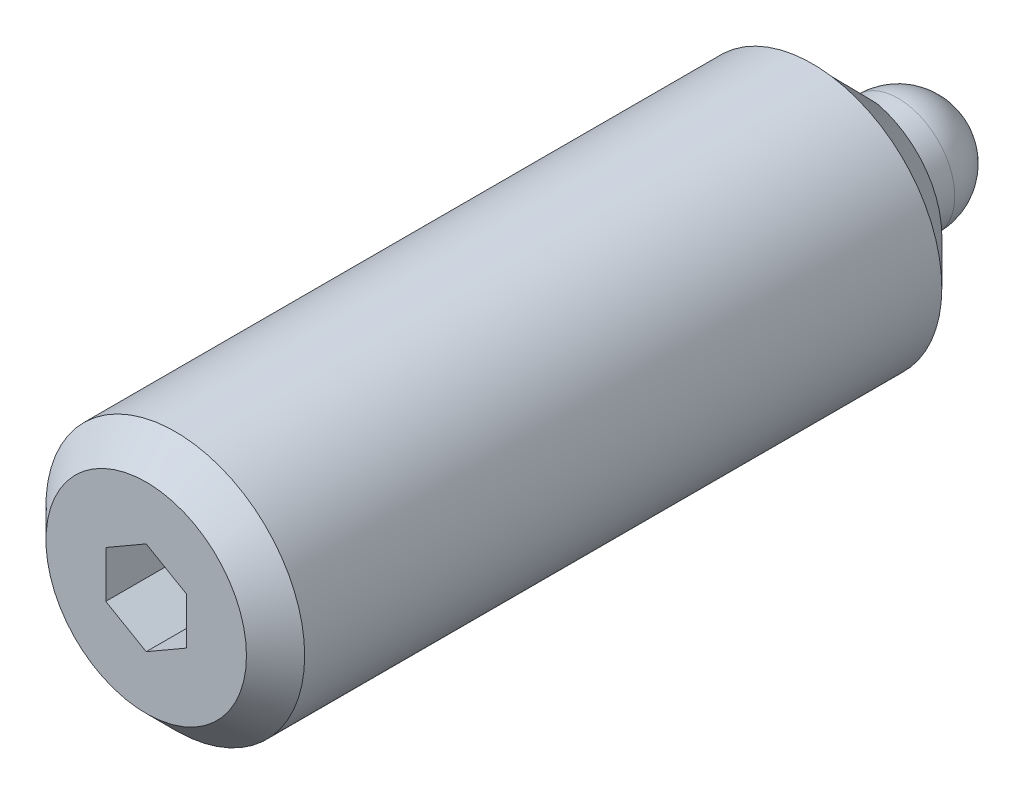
ISO-10303-21;
HEADER;
FILE_DESCRIPTION(('STEP AP214'),'2;1');
FILE_NAME('part.step','',(''),(''),'','','');
FILE_SCHEMA(('AUTOMOTIVE_DESIGN { 1 0 10303 214 1 1 1 1 }'));
ENDSEC;
DATA;
#1=APPLICATION_CONTEXT('core data for automotive mechanical design processes');
#2=APPLICATION_PROTOCOL_DEFINITION('international standard','automotive_design',2000,#1);
#3=PRODUCT_CONTEXT('',#1,'mechanical');
#4=PRODUCT('Part','Part','',(#3));
#5=PRODUCT_RELATED_PRODUCT_CATEGORY('part','',(#4));
#6=PRODUCT_DEFINITION_FORMATION('','',#4);
#7=PRODUCT_DEFINITION_CONTEXT('part definition',#1,'design');
#8=PRODUCT_DEFINITION('design','',#6,#7);
#9=PRODUCT_DEFINITION_SHAPE('','',#8);
#10=(LENGTH_UNIT() NAMED_UNIT(*) SI_UNIT(.MILLI.,.METRE.));
#11=(NAMED_UNIT(*) PLANE_ANGLE_UNIT() SI_UNIT($,.RADIAN.));
#12=(NAMED_UNIT(*) SI_UNIT($,.STERADIAN.) SOLID_ANGLE_UNIT());
#13=UNCERTAINTY_MEASURE_WITH_UNIT(LENGTH_MEASURE(1.E-05),#10,'distance_accuracy_value','');
#14=(GEOMETRIC_REPRESENTATION_CONTEXT(3) GLOBAL_UNCERTAINTY_ASSIGNED_CONTEXT((#13)) GLOBAL_UNIT_ASSIGNED_CONTEXT((#10,
#11,#12)) REPRESENTATION_CONTEXT('',''));
#15=CARTESIAN_POINT('',(0.,0.,0.));
#16=DIRECTION('',(0.,0.,1.));
#17=DIRECTION('',(1.,0.,0.));
#18=AXIS2_PLACEMENT_3D('',#15,#16,#17);
#19=CARTESIAN_POINT('',(0.,1.75,3.));
#20=DIRECTION('',(0.,0.,-1.));
#21=DIRECTION('',(-1.,0.,0.));
#22=AXIS2_PLACEMENT_3D('',#19,#20,#21);
#23=PLANE('',#22);
#24=DIRECTION('',(0.,-1.,0.));
#25=VECTOR('',#24,1.);
#26=CARTESIAN_POINT('',(0.6,-1.64392822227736,3.));
#27=LINE('',#26,#25);
#28=CARTESIAN_POINT('',(0.6,-1.64392822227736,3.));
#29=VERTEX_POINT('',#28);
#30=CARTESIAN_POINT('',(0.6,-2.5298221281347,3.));
#31=VERTEX_POINT('',#30);
#32=EDGE_CURVE('E130',#29,#31,#27,.T.);
#33=ORIENTED_EDGE('',*,*,#32,.F.);
#34=CARTESIAN_POINT('',(0.,0.,3.));
#35=DIRECTION('',(0.,0.,-1.));
#36=DIRECTION('',(-1.,0.,0.));
#37=AXIS2_PLACEMENT_3D('',#34,#35,#36);
#38=CIRCLE('',#37,1.75);
#39=CARTESIAN_POINT('',(0.6,1.64392822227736,3.));
#40=VERTEX_POINT('',#39);
#41=EDGE_CURVE('E219',#40,#29,#38,.T.);
#42=ORIENTED_EDGE('',*,*,#41,.F.);
#43=DIRECTION('',(0.,-1.,0.));
#44=VECTOR('',#43,1.);
#45=CARTESIAN_POINT('',(0.6,4.62355278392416,3.));
#46=LINE('',#45,#44);
#47=CARTESIAN_POINT('',(0.6,2.5298221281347,3.));
#48=VERTEX_POINT('',#47);
#49=EDGE_CURVE('E149',#48,#40,#46,.T.);
#50=ORIENTED_EDGE('',*,*,#49,.F.);
#51=CARTESIAN_POINT('',(0.,0.,3.));
#52=DIRECTION('',(0.,0.,-1.));
#53=DIRECTION('',(-1.,0.,0.));
#54=AXIS2_PLACEMENT_3D('',#51,#52,#53);
#55=CIRCLE('',#54,2.6);
#56=EDGE_CURVE('E228',#48,#31,#55,.T.);
#57=ORIENTED_EDGE('',*,*,#56,.T.);
#58=EDGE_LOOP('',(#33,#42,#50,#57));
#59=FACE_BOUND('',#58,.T.);
#60=ADVANCED_FACE('F14',(#59),#23,.T.);
#61=CARTESIAN_POINT('',(0.,0.,3.));
#62=DIRECTION('',(0.,0.,1.));
#63=DIRECTION('',(1.,0.,0.));
#64=AXIS2_PLACEMENT_3D('',#61,#62,#63);
#65=CONICAL_SURFACE('',#64,2.6,0.785398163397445);
#66=CARTESIAN_POINT('',(0.6,-0.316435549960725,1.07832990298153));
#67=CARTESIAN_POINT('',(0.6,-0.342049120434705,1.09030088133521));
#68=CARTESIAN_POINT('',(0.6,-0.367221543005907,1.10315656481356));
#69=CARTESIAN_POINT('',(0.6,-0.416776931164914,1.13024973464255));
#70=CARTESIAN_POINT('',(0.6,-0.441160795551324,1.14448556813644));
#71=CARTESIAN_POINT('',(0.6,-0.489209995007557,1.17393130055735));
#72=CARTESIAN_POINT('',(0.6,-0.512877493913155,1.18913771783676));
#73=CARTESIAN_POINT('',(0.6,-0.55969644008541,1.22033885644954));
#74=CARTESIAN_POINT('',(0.6,-0.58284770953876,1.23633384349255));
#75=CARTESIAN_POINT('',(0.6,-0.65147502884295,1.28508689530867));
#76=CARTESIAN_POINT('',(0.6,-0.696316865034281,1.31873506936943));
#77=CARTESIAN_POINT('',(0.6,-0.784878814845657,1.38755469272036));
#78=CARTESIAN_POINT('',(0.6,-0.828597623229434,1.42272779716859));
#79=CARTESIAN_POINT('',(0.6,-0.918811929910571,1.49704479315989));
#80=CARTESIAN_POINT('',(0.6,-0.965235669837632,1.53627551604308));
#81=CARTESIAN_POINT('',(0.6,-1.05739460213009,1.61553936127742));
#82=CARTESIAN_POINT('',(0.6,-1.10312974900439,1.65557253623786));
#83=CARTESIAN_POINT('',(0.6,-1.23960662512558,1.7765268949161));
#84=CARTESIAN_POINT('',(0.6,-1.32960230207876,1.85828816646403));
#85=CARTESIAN_POINT('',(0.6,-1.5084598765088,2.0230422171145));
#86=CARTESIAN_POINT('',(0.6,-1.59732170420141,2.10603507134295));
#87=CARTESIAN_POINT('',(0.6,-1.77431085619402,2.27277843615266));
#88=CARTESIAN_POINT('',(0.6,-1.86243826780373,2.3565288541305));
#89=CARTESIAN_POINT('',(0.6,-2.03884556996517,2.52513938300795));
#90=CARTESIAN_POINT('',(0.6,-2.12712196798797,2.61000314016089));
#91=CARTESIAN_POINT('',(0.6,-2.30333427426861,2.78008863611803));
#92=CARTESIAN_POINT('',(0.6,-2.3912701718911,2.86531038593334));
#93=CARTESIAN_POINT('',(0.6,-2.65467456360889,3.12131790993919));
#94=CARTESIAN_POINT('',(0.6,-2.82977616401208,3.29248094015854));
#95=CARTESIAN_POINT('',(0.6,-3.21925194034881,3.67442164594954));
#96=CARTESIAN_POINT('',(0.6,-3.43348622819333,3.88534172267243));
#97=CARTESIAN_POINT('',(0.6,-3.86149450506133,4.30767822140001));
#98=CARTESIAN_POINT('',(0.6,-4.07526846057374,4.51909467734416));
#99=CARTESIAN_POINT('',(0.6,-4.50037387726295,4.94009936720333));
#100=CARTESIAN_POINT('',(0.6,-4.71170829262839,5.14968461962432));
#101=CARTESIAN_POINT('',(0.6,-5.13416047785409,5.56904170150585));
#102=CARTESIAN_POINT('',(0.6,-5.34527826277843,5.77881351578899));
#103=CARTESIAN_POINT('',(0.6,-5.55634000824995,5.98864154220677));
#104=B_SPLINE_CURVE_WITH_KNOTS('',3,(#66,#67,#68,#69,#70,#71,#72,#73,#74,#75,#76,#77,#78,#79,
#80,#81,#82,#83,#84,#85,#86,#87,#88,#89,#90,#91,#92,#93,#94,#95,#96,#97,#98,#99,#100,#101,#102,
#103),.UNSPECIFIED.,.F.,.F.,(4,2,2,2,2,2,2,2,2,2,2,2,2,2,2,2,2,2,4),(0.,0.0847656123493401,
0.169430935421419,0.25380798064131,0.338213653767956,0.506342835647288,0.674659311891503,
0.856985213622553,1.03932310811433,1.40406749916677,1.76883423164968,2.13355696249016,
2.50091282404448,2.86828006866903,3.60286309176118,4.50477798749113,5.40675645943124,
6.29966947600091,7.19251550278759),.UNSPECIFIED.);
#105=CARTESIAN_POINT('',(0.6,-3.95474398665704,4.4));
#106=VERTEX_POINT('',#105);
#107=EDGE_CURVE('E9',#31,#106,#104,.T.);
#108=ORIENTED_EDGE('',*,*,#107,.F.);
#109=ORIENTED_EDGE('',*,*,#56,.F.);
#110=CARTESIAN_POINT('',(0.6,5.01244134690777,5.44822426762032));
#111=CARTESIAN_POINT('',(0.6,4.82054600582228,5.25770551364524));
#112=CARTESIAN_POINT('',(0.6,4.62858848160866,5.06724910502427));
#113=CARTESIAN_POINT('',(0.6,4.24445981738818,4.68657611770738));
#114=CARTESIAN_POINT('',(0.6,4.05228869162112,4.49635952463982));
#115=CARTESIAN_POINT('',(0.6,3.667674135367,4.11631134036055));
#116=CARTESIAN_POINT('',(0.6,3.4752307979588,3.92647965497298));
#117=CARTESIAN_POINT('',(0.6,3.08981097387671,3.54733285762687));
#118=CARTESIAN_POINT('',(0.6,2.89683445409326,3.35801777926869));
#119=CARTESIAN_POINT('',(0.6,2.62414822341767,3.09181500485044));
#120=CARTESIAN_POINT('',(0.6,2.54482409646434,3.01453245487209));
#121=CARTESIAN_POINT('',(0.6,2.38596933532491,2.86018171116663));
#122=CARTESIAN_POINT('',(0.6,2.30643870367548,2.78311351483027));
#123=CARTESIAN_POINT('',(0.6,2.14711369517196,2.62927512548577));
#124=CARTESIAN_POINT('',(0.6,2.06731936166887,2.55250488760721));
#125=CARTESIAN_POINT('',(0.6,1.90734638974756,2.39935828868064));
#126=CARTESIAN_POINT('',(0.6,1.82716773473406,2.32298194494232));
#127=CARTESIAN_POINT('',(0.6,1.66622286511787,2.17076654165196));
#128=CARTESIAN_POINT('',(0.6,1.58545636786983,2.09492778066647));
#129=CARTESIAN_POINT('',(0.6,1.42311729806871,1.94413311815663));
#130=CARTESIAN_POINT('',(0.6,1.34154482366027,1.86917711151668));
#131=CARTESIAN_POINT('',(0.6,1.21817701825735,1.7578095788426));
#132=CARTESIAN_POINT('',(0.6,1.1768736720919,1.7208538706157));
#133=CARTESIAN_POINT('',(0.6,1.09383421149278,1.64743627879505));
#134=CARTESIAN_POINT('',(0.6,1.05209812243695,1.61097436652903));
#135=CARTESIAN_POINT('',(0.6,0.968037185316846,1.53869511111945));
#136=CARTESIAN_POINT('',(0.6,0.925712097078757,1.50287804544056));
#137=CARTESIAN_POINT('',(0.6,0.840247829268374,1.43221316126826));
#138=CARTESIAN_POINT('',(0.6,0.797108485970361,1.39736554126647));
#139=CARTESIAN_POINT('',(0.6,0.753449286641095,1.36316448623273));
#140=B_SPLINE_CURVE_WITH_KNOTS('',3,(#110,#111,#112,#113,#114,#115,#116,#117,#118,#119,#120,
#121,#122,#123,#124,#125,#126,#127,#128,#129,#130,#131,#132,#133,#134,#135,#136,#137,#138,#139),
.UNSPECIFIED.,.F.,.F.,(4,2,2,2,2,2,2,2,2,2,2,2,2,2,4),(0.,0.811228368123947,1.6224055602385,
2.43335185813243,3.24434969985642,3.57659057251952,3.90882738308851,4.24101205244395,
4.5732111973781,4.90558229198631,5.23791340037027,5.40417889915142,5.57043470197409,
5.73676040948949,5.90311992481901),.UNSPECIFIED.);
#141=CARTESIAN_POINT('',(0.6,3.95474398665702,4.4));
#142=VERTEX_POINT('',#141);
#143=EDGE_CURVE('E243',#142,#48,#140,.T.);
#144=ORIENTED_EDGE('',*,*,#143,.F.);
#145=CARTESIAN_POINT('',(0.,0.,4.4));
#146=DIRECTION('',(0.,0.,-1.));
#147=DIRECTION('',(-1.,0.,0.));
#148=AXIS2_PLACEMENT_3D('',#145,#146,#147);
#149=CIRCLE('',#148,4.);
#150=EDGE_CURVE('E231',#106,#142,#149,.F.);
#151=ORIENTED_EDGE('',*,*,#150,.F.);
#152=EDGE_LOOP('',(#108,#109,#144,#151));
#153=FACE_BOUND('',#152,.T.);
#154=ADVANCED_FACE('F304',(#153),#65,.T.);
#155=CARTESIAN_POINT('',(0.,4.,25.));
#156=DIRECTION('',(0.,0.,1.));
#157=DIRECTION('',(1.,0.,0.));
#158=AXIS2_PLACEMENT_3D('',#155,#156,#157);
#159=PLANE('',#158);
#160=CARTESIAN_POINT('',(0.,0.,25.));
#161=DIRECTION('',(0.,0.,1.));
#162=DIRECTION('',(1.,0.,0.));
#163=AXIS2_PLACEMENT_3D('',#160,#161,#162);
#164=CIRCLE('',#163,3.1);
#165=CARTESIAN_POINT('',(3.1,0.,25.));
#166=VERTEX_POINT('',#165);
#167=EDGE_CURVE('E224',#166,#166,#164,.T.);
#168=ORIENTED_EDGE('',*,*,#167,.T.);
#169=EDGE_LOOP('',(#168));
#170=FACE_BOUND('',#169,.T.);
#171=DIRECTION('',(0.866025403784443,-0.499999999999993,0.));
#172=VECTOR('',#171,1.);
#173=CARTESIAN_POINT('',(-1.25,-0.721687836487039,25.));
#174=LINE('',#173,#172);
#175=CARTESIAN_POINT('',(-1.25,-0.72168783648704,25.));
#176=VERTEX_POINT('',#175);
#177=CARTESIAN_POINT('',(0.,-1.44337567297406,25.));
#178=VERTEX_POINT('',#177);
#179=EDGE_CURVE('E181',#176,#178,#174,.T.);
#180=ORIENTED_EDGE('',*,*,#179,.F.);
#181=DIRECTION('',(0.,1.,0.));
#182=VECTOR('',#181,1.);
#183=CARTESIAN_POINT('',(-1.25,-0.721687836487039,25.));
#184=LINE('',#183,#182);
#185=CARTESIAN_POINT('',(-1.25,0.721687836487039,25.));
#186=VERTEX_POINT('',#185);
#187=EDGE_CURVE('E164',#176,#186,#184,.T.);
#188=ORIENTED_EDGE('',*,*,#187,.T.);
#189=DIRECTION('',(0.866025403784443,0.499999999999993,0.));
#190=VECTOR('',#189,1.);
#191=CARTESIAN_POINT('',(-1.25,0.721687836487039,25.));
#192=LINE('',#191,#190);
#193=CARTESIAN_POINT('',(0.,1.44337567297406,25.));
#194=VERTEX_POINT('',#193);
#195=EDGE_CURVE('E169',#186,#194,#192,.T.);
#196=ORIENTED_EDGE('',*,*,#195,.T.);
#197=DIRECTION('',(-0.866025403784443,0.499999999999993,0.));
#198=VECTOR('',#197,1.);
#199=CARTESIAN_POINT('',(1.25,0.721687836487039,25.));
#200=LINE('',#199,#198);
#201=CARTESIAN_POINT('',(1.25,0.721687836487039,25.));
#202=VERTEX_POINT('',#201);
#203=EDGE_CURVE('E172',#202,#194,#200,.T.);
#204=ORIENTED_EDGE('',*,*,#203,.F.);
#205=DIRECTION('',(0.,1.,0.));
#206=VECTOR('',#205,1.);
#207=CARTESIAN_POINT('',(1.25,-0.721687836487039,25.));
#208=LINE('',#207,#206);
#209=CARTESIAN_POINT('',(1.25,-0.721687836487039,25.));
#210=VERTEX_POINT('',#209);
#211=EDGE_CURVE('E175',#210,#202,#208,.T.);
#212=ORIENTED_EDGE('',*,*,#211,.F.);
#213=DIRECTION('',(-0.866025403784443,-0.499999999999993,0.));
#214=VECTOR('',#213,1.);
#215=CARTESIAN_POINT('',(1.25,-0.721687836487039,25.));
#216=LINE('',#215,#214);
#217=EDGE_CURVE('E178',#210,#178,#216,.T.);
#218=ORIENTED_EDGE('',*,*,#217,.T.);
#219=EDGE_LOOP('',(#180,#188,#196,#204,#212,#218));
#220=FACE_BOUND('',#219,.T.);
#221=ADVANCED_FACE('F301',(#170,#220),#159,.T.);
#222=CARTESIAN_POINT('',(0.,0.,1.75));
#223=DIRECTION('',(-1.,0.,0.));
#224=DIRECTION('',(0.,0.,1.));
#225=AXIS2_PLACEMENT_3D('',#222,#223,#224);
#226=SPHERICAL_SURFACE('',#225,1.75);
#227=CARTESIAN_POINT('',(0.,0.,1.75));
#228=DIRECTION('',(0.,0.,-1.));
#229=DIRECTION('',(-1.,0.,0.));
#230=AXIS2_PLACEMENT_3D('',#227,#228,#229);
#231=SPHERICAL_SURFACE('',#230,1.75);
#232=CARTESIAN_POINT('',(0.,0.,1.75));
#233=DIRECTION('',(0.,0.,-1.));
#234=DIRECTION('',(-1.,0.,0.));
#235=AXIS2_PLACEMENT_3D('',#232,#233,#234);
#236=CIRCLE('',#235,1.75);
#237=CARTESIAN_POINT('',(-1.75,0.,1.75));
#238=VERTEX_POINT('',#237);
#239=EDGE_CURVE('E215',#238,#238,#236,.T.);
#240=ORIENTED_EDGE('',*,*,#239,.T.);
#241=EDGE_LOOP('',(#240));
#242=FACE_BOUND('',#241,.T.);
#243=ADVANCED_FACE('F299',(#242),#231,.T.);
#244=CARTESIAN_POINT('',(0.,0.,-1.));
#245=DIRECTION('',(0.,0.,-1.));
#246=DIRECTION('',(-1.,0.,0.));
#247=AXIS2_PLACEMENT_3D('',#244,#245,#246);
#248=CYLINDRICAL_SURFACE('',#247,4.);
#249=CARTESIAN_POINT('',(-0.6,3.95474398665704,4.4));
#250=VERTEX_POINT('',#249);
#251=EDGE_CURVE('E232',#142,#250,#149,.F.);
#252=ORIENTED_EDGE('',*,*,#251,.T.);
#253=CARTESIAN_POINT('',(-0.6,-3.95474398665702,4.4));
#254=VERTEX_POINT('',#253);
#255=EDGE_CURVE('E236',#250,#254,#149,.F.);
#256=ORIENTED_EDGE('',*,*,#255,.T.);
#257=EDGE_CURVE('E127',#254,#106,#149,.F.);
#258=ORIENTED_EDGE('',*,*,#257,.T.);
#259=ORIENTED_EDGE('',*,*,#150,.T.);
#260=EDGE_LOOP('',(#252,#256,#258,#259));
#261=FACE_BOUND('',#260,.T.);
#262=CARTESIAN_POINT('',(0.,0.,24.1));
#263=DIRECTION('',(0.,0.,1.));
#264=DIRECTION('',(1.,0.,0.));
#265=AXIS2_PLACEMENT_3D('',#262,#263,#264);
#266=CIRCLE('',#265,4.);
#267=CARTESIAN_POINT('',(4.,0.,24.1));
#268=VERTEX_POINT('',#267);
#269=EDGE_CURVE('E221',#268,#268,#266,.F.);
#270=ORIENTED_EDGE('',*,*,#269,.T.);
#271=EDGE_LOOP('',(#270));
#272=FACE_BOUND('',#271,.T.);
#273=ADVANCED_FACE('F295',(#261,#272),#248,.T.);
#274=DIRECTION('',(0.,1.,0.));
#275=VECTOR('',#274,1.);
#276=CARTESIAN_POINT('',(-0.6,-1.64392822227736,3.));
#277=LINE('',#276,#275);
#278=CARTESIAN_POINT('',(-0.6,-2.5298221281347,3.));
#279=VERTEX_POINT('',#278);
#280=CARTESIAN_POINT('',(-0.6,-1.64392822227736,3.));
#281=VERTEX_POINT('',#280);
#282=EDGE_CURVE('E136',#279,#281,#277,.T.);
#283=ORIENTED_EDGE('',*,*,#282,.F.);
#284=CARTESIAN_POINT('',(-0.6,2.5298221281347,3.));
#285=VERTEX_POINT('',#284);
#286=EDGE_CURVE('E227',#279,#285,#55,.T.);
#287=ORIENTED_EDGE('',*,*,#286,.T.);
#288=DIRECTION('',(0.,1.,0.));
#289=VECTOR('',#288,1.);
#290=CARTESIAN_POINT('',(-0.6,4.62355278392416,3.));
#291=LINE('',#290,#289);
#292=CARTESIAN_POINT('',(-0.6,1.64392822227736,3.));
#293=VERTEX_POINT('',#292);
#294=EDGE_CURVE('E154',#293,#285,#291,.T.);
#295=ORIENTED_EDGE('',*,*,#294,.F.);
#296=EDGE_CURVE('E218',#281,#293,#38,.T.);
#297=ORIENTED_EDGE('',*,*,#296,.F.);
#298=EDGE_LOOP('',(#283,#287,#295,#297));
#299=FACE_BOUND('',#298,.T.);
#300=ADVANCED_FACE('F292',(#299),#23,.T.);
#301=CARTESIAN_POINT('',(0.,0.,-1.));
#302=DIRECTION('',(0.,0.,-1.));
#303=DIRECTION('',(-1.,0.,0.));
#304=AXIS2_PLACEMENT_3D('',#301,#302,#303);
#305=CYLINDRICAL_SURFACE('',#304,1.75);
#306=ORIENTED_EDGE('',*,*,#41,.T.);
#307=DIRECTION('',(0.,0.,-1.));
#308=VECTOR('',#307,1.);
#309=CARTESIAN_POINT('',(0.6,-1.64392822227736,4.4));
#310=LINE('',#309,#308);
#311=CARTESIAN_POINT('',(0.6,-1.64392822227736,4.4));
#312=VERTEX_POINT('',#311);
#313=EDGE_CURVE('E139',#312,#29,#310,.T.);
#314=ORIENTED_EDGE('',*,*,#313,.F.);
#315=CARTESIAN_POINT('',(0.,0.,4.4));
#316=DIRECTION('',(0.,0.,1.));
#317=DIRECTION('',(-1.,0.,0.));
#318=AXIS2_PLACEMENT_3D('',#315,#316,#317);
#319=CIRCLE('',#318,1.75);
#320=CARTESIAN_POINT('',(-0.6,-1.64392822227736,4.4));
#321=VERTEX_POINT('',#320);
#322=EDGE_CURVE('E125',#321,#312,#319,.T.);
#323=ORIENTED_EDGE('',*,*,#322,.F.);
#324=DIRECTION('',(0.,0.,-1.));
#325=VECTOR('',#324,1.);
#326=CARTESIAN_POINT('',(-0.6,-1.64392822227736,4.4));
#327=LINE('',#326,#325);
#328=EDGE_CURVE('E133',#321,#281,#327,.T.);
#329=ORIENTED_EDGE('',*,*,#328,.T.);
#330=ORIENTED_EDGE('',*,*,#296,.T.);
#331=DIRECTION('',(0.,0.,-1.));
#332=VECTOR('',#331,1.);
#333=CARTESIAN_POINT('',(-0.6,1.64392822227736,4.4));
#334=LINE('',#333,#332);
#335=CARTESIAN_POINT('',(-0.6,1.64392822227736,4.4));
#336=VERTEX_POINT('',#335);
#337=EDGE_CURVE('E161',#336,#293,#334,.T.);
#338=ORIENTED_EDGE('',*,*,#337,.F.);
#339=CARTESIAN_POINT('',(0.,0.,4.4));
#340=DIRECTION('',(0.,0.,1.));
#341=DIRECTION('',(-1.,0.,0.));
#342=AXIS2_PLACEMENT_3D('',#339,#340,#341);
#343=CIRCLE('',#342,1.75);
#344=CARTESIAN_POINT('',(0.6,1.64392822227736,4.4));
#345=VERTEX_POINT('',#344);
#346=EDGE_CURVE('E153',#345,#336,#343,.T.);
#347=ORIENTED_EDGE('',*,*,#346,.F.);
#348=DIRECTION('',(0.,0.,-1.));
#349=VECTOR('',#348,1.);
#350=CARTESIAN_POINT('',(0.6,1.64392822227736,4.4));
#351=LINE('',#350,#349);
#352=EDGE_CURVE('E157',#345,#40,#351,.T.);
#353=ORIENTED_EDGE('',*,*,#352,.T.);
#354=EDGE_LOOP('',(#306,#314,#323,#329,#330,#338,#347,#353));
#355=FACE_BOUND('',#354,.T.);
#356=ORIENTED_EDGE('',*,*,#239,.F.);
#357=EDGE_LOOP('',(#356));
#358=FACE_BOUND('',#357,.T.);
#359=ADVANCED_FACE('F142',(#355,#358),#305,.T.);
#360=CARTESIAN_POINT('',(-1.25,-0.721687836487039,22.));
#361=DIRECTION('',(1.,0.,0.));
#362=DIRECTION('',(0.,0.,-1.));
#363=AXIS2_PLACEMENT_3D('',#360,#361,#362);
#364=PLANE('',#363);
#365=DIRECTION('',(0.,0.,1.));
#366=VECTOR('',#365,1.);
#367=CARTESIAN_POINT('',(-1.25,0.721687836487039,22.));
#368=LINE('',#367,#366);
#369=CARTESIAN_POINT('',(-1.25,0.721687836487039,22.));
#370=VERTEX_POINT('',#369);
#371=EDGE_CURVE('E213',#370,#186,#368,.T.);
#372=ORIENTED_EDGE('',*,*,#371,.T.);
#373=ORIENTED_EDGE('',*,*,#187,.F.);
#374=DIRECTION('',(0.,0.,1.));
#375=VECTOR('',#374,1.);
#376=CARTESIAN_POINT('',(-1.25,-0.721687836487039,22.));
#377=LINE('',#376,#375);
#378=CARTESIAN_POINT('',(-1.25,-0.721687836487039,22.));
#379=VERTEX_POINT('',#378);
#380=EDGE_CURVE('E202',#379,#176,#377,.T.);
#381=ORIENTED_EDGE('',*,*,#380,.F.);
#382=DIRECTION('',(0.,1.,0.));
#383=VECTOR('',#382,1.);
#384=CARTESIAN_POINT('',(-1.25,-0.721687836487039,22.));
#385=LINE('',#384,#383);
#386=EDGE_CURVE('E184',#379,#370,#385,.T.);
#387=ORIENTED_EDGE('',*,*,#386,.T.);
#388=EDGE_LOOP('',(#372,#373,#381,#387));
#389=FACE_BOUND('',#388,.T.);
#390=ADVANCED_FACE('F268',(#389),#364,.T.);
#391=CARTESIAN_POINT('',(-1.25,0.721687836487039,22.));
#392=DIRECTION('',(0.499999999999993,-0.866025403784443,0.));
#393=DIRECTION('',(0.866025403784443,0.499999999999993,0.));
#394=AXIS2_PLACEMENT_3D('',#391,#392,#393);
#395=PLANE('',#394);
#396=DIRECTION('',(0.,0.,1.));
#397=VECTOR('',#396,1.);
#398=CARTESIAN_POINT('',(0.,1.44337567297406,22.));
#399=LINE('',#398,#397);
#400=CARTESIAN_POINT('',(0.,1.44337567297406,22.));
#401=VERTEX_POINT('',#400);
#402=EDGE_CURVE('E211',#401,#194,#399,.T.);
#403=ORIENTED_EDGE('',*,*,#402,.T.);
#404=ORIENTED_EDGE('',*,*,#195,.F.);
#405=ORIENTED_EDGE('',*,*,#371,.F.);
#406=DIRECTION('',(0.866025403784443,0.499999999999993,0.));
#407=VECTOR('',#406,1.);
#408=CARTESIAN_POINT('',(-1.25,0.721687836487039,22.));
#409=LINE('',#408,#407);
#410=EDGE_CURVE('E187',#370,#401,#409,.T.);
#411=ORIENTED_EDGE('',*,*,#410,.T.);
#412=EDGE_LOOP('',(#403,#404,#405,#411));
#413=FACE_BOUND('',#412,.T.);
#414=ADVANCED_FACE('F271',(#413),#395,.T.);
#415=CARTESIAN_POINT('',(1.25,0.721687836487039,22.));
#416=DIRECTION('',(0.499999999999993,0.866025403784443,0.));
#417=DIRECTION('',(-0.866025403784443,0.499999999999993,0.));
#418=AXIS2_PLACEMENT_3D('',#415,#416,#417);
#419=PLANE('',#418);
#420=DIRECTION('',(0.,0.,1.));
#421=VECTOR('',#420,1.);
#422=CARTESIAN_POINT('',(1.25,0.721687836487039,22.));
#423=LINE('',#422,#421);
#424=CARTESIAN_POINT('',(1.25,0.721687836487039,22.));
#425=VERTEX_POINT('',#424);
#426=EDGE_CURVE('E209',#425,#202,#423,.T.);
#427=ORIENTED_EDGE('',*,*,#426,.T.);
#428=ORIENTED_EDGE('',*,*,#203,.T.);
#429=ORIENTED_EDGE('',*,*,#402,.F.);
#430=DIRECTION('',(-0.866025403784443,0.499999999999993,0.));
#431=VECTOR('',#430,1.);
#432=CARTESIAN_POINT('',(1.25,0.721687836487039,22.));
#433=LINE('',#432,#431);
#434=EDGE_CURVE('E190',#425,#401,#433,.T.);
#435=ORIENTED_EDGE('',*,*,#434,.F.);
#436=EDGE_LOOP('',(#427,#428,#429,#435));
#437=FACE_BOUND('',#436,.T.);
#438=ADVANCED_FACE('F282',(#437),#419,.F.);
#439=CARTESIAN_POINT('',(1.25,-0.721687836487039,22.));
#440=DIRECTION('',(1.,0.,0.));
#441=DIRECTION('',(0.,0.,-1.));
#442=AXIS2_PLACEMENT_3D('',#439,#440,#441);
#443=PLANE('',#442);
#444=DIRECTION('',(0.,0.,1.));
#445=VECTOR('',#444,1.);
#446=CARTESIAN_POINT('',(1.25,-0.721687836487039,22.));
#447=LINE('',#446,#445);
#448=CARTESIAN_POINT('',(1.25,-0.721687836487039,22.));
#449=VERTEX_POINT('',#448);
#450=EDGE_CURVE('E207',#449,#210,#447,.T.);
#451=ORIENTED_EDGE('',*,*,#450,.T.);
#452=ORIENTED_EDGE('',*,*,#211,.T.);
#453=ORIENTED_EDGE('',*,*,#426,.F.);
#454=DIRECTION('',(0.,1.,0.));
#455=VECTOR('',#454,1.);
#456=CARTESIAN_POINT('',(1.25,-0.721687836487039,22.));
#457=LINE('',#456,#455);
#458=EDGE_CURVE('E193',#449,#425,#457,.T.);
#459=ORIENTED_EDGE('',*,*,#458,.F.);
#460=EDGE_LOOP('',(#451,#452,#453,#459));
#461=FACE_BOUND('',#460,.T.);
#462=ADVANCED_FACE('F278',(#461),#443,.F.);
#463=CARTESIAN_POINT('',(1.25,-0.721687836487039,22.));
#464=DIRECTION('',(-0.499999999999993,0.866025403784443,0.));
#465=DIRECTION('',(-0.866025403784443,-0.499999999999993,0.));
#466=AXIS2_PLACEMENT_3D('',#463,#464,#465);
#467=PLANE('',#466);
#468=DIRECTION('',(0.,0.,1.));
#469=VECTOR('',#468,1.);
#470=CARTESIAN_POINT('',(0.,-1.44337567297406,22.));
#471=LINE('',#470,#469);
#472=CARTESIAN_POINT('',(0.,-1.44337567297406,22.));
#473=VERTEX_POINT('',#472);
#474=EDGE_CURVE('E205',#473,#178,#471,.T.);
#475=ORIENTED_EDGE('',*,*,#474,.T.);
#476=ORIENTED_EDGE('',*,*,#217,.F.);
#477=ORIENTED_EDGE('',*,*,#450,.F.);
#478=DIRECTION('',(-0.866025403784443,-0.499999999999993,0.));
#479=VECTOR('',#478,1.);
#480=CARTESIAN_POINT('',(1.25,-0.721687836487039,22.));
#481=LINE('',#480,#479);
#482=EDGE_CURVE('E196',#449,#473,#481,.T.);
#483=ORIENTED_EDGE('',*,*,#482,.T.);
#484=EDGE_LOOP('',(#475,#476,#477,#483));
#485=FACE_BOUND('',#484,.T.);
#486=ADVANCED_FACE('F267',(#485),#467,.T.);
#487=CARTESIAN_POINT('',(-1.25,-0.721687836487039,22.));
#488=DIRECTION('',(-0.499999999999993,-0.866025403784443,0.));
#489=DIRECTION('',(0.866025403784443,-0.499999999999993,0.));
#490=AXIS2_PLACEMENT_3D('',#487,#488,#489);
#491=PLANE('',#490);
#492=DIRECTION('',(0.866025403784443,-0.499999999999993,0.));
#493=VECTOR('',#492,1.);
#494=CARTESIAN_POINT('',(-1.25,-0.721687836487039,22.));
#495=LINE('',#494,#493);
#496=EDGE_CURVE('E199',#379,#473,#495,.T.);
#497=ORIENTED_EDGE('',*,*,#496,.F.);
#498=ORIENTED_EDGE('',*,*,#380,.T.);
#499=ORIENTED_EDGE('',*,*,#179,.T.);
#500=ORIENTED_EDGE('',*,*,#474,.F.);
#501=EDGE_LOOP('',(#497,#498,#499,#500));
#502=FACE_BOUND('',#501,.T.);
#503=ADVANCED_FACE('F265',(#502),#491,.F.);
#504=CARTESIAN_POINT('',(-1.25,2.16506350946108,22.));
#505=DIRECTION('',(0.,0.,1.));
#506=DIRECTION('',(1.,0.,0.));
#507=AXIS2_PLACEMENT_3D('',#504,#505,#506);
#508=PLANE('',#507);
#509=ORIENTED_EDGE('',*,*,#386,.F.);
#510=ORIENTED_EDGE('',*,*,#496,.T.);
#511=ORIENTED_EDGE('',*,*,#482,.F.);
#512=ORIENTED_EDGE('',*,*,#458,.T.);
#513=ORIENTED_EDGE('',*,*,#434,.T.);
#514=ORIENTED_EDGE('',*,*,#410,.F.);
#515=EDGE_LOOP('',(#509,#510,#511,#512,#513,#514));
#516=FACE_BOUND('',#515,.T.);
#517=ADVANCED_FACE('F261',(#516),#508,.T.);
#518=CARTESIAN_POINT('',(0.,0.,24.1));
#519=DIRECTION('',(0.,0.,-1.));
#520=DIRECTION('',(-1.,0.,0.));
#521=AXIS2_PLACEMENT_3D('',#518,#519,#520);
#522=CONICAL_SURFACE('',#521,4.,0.78539816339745);
#523=ORIENTED_EDGE('',*,*,#167,.F.);
#524=EDGE_LOOP('',(#523));
#525=FACE_BOUND('',#524,.T.);
#526=ORIENTED_EDGE('',*,*,#269,.F.);
#527=EDGE_LOOP('',(#526));
#528=FACE_BOUND('',#527,.T.);
#529=ADVANCED_FACE('F264',(#525,#528),#522,.T.);
#530=CARTESIAN_POINT('',(-0.6,-5.55634000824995,5.98864154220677));
#531=CARTESIAN_POINT('',(-0.6,-5.34409106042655,5.77763263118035));
#532=CARTESIAN_POINT('',(-0.6,-5.13178496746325,5.56668107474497));
#533=CARTESIAN_POINT('',(-0.6,-4.70702677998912,5.14504009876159));
#534=CARTESIAN_POINT('',(-0.6,-4.49457474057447,4.93435062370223));
#535=CARTESIAN_POINT('',(-0.6,-4.06953586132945,4.51342310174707));
#536=CARTESIAN_POINT('',(-0.6,-3.85694923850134,4.30318483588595));
#537=CARTESIAN_POINT('',(-0.6,-3.53768495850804,3.98816394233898));
#538=CARTESIAN_POINT('',(-0.6,-3.43118620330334,3.88320002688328));
#539=CARTESIAN_POINT('',(-0.6,-3.21802761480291,3.67342963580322));
#540=CARTESIAN_POINT('',(-0.6,-3.11136777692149,3.5686231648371));
#541=CARTESIAN_POINT('',(-0.6,-2.89767154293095,3.35906429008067));
#542=CARTESIAN_POINT('',(-0.6,-2.79063481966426,3.25431221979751));
#543=CARTESIAN_POINT('',(-0.6,-2.57627838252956,3.04512023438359));
#544=CARTESIAN_POINT('',(-0.6,-2.46895869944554,2.94068028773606));
#545=CARTESIAN_POINT('',(-0.6,-2.25398123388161,2.73232305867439));
#546=CARTESIAN_POINT('',(-0.6,-2.14632379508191,2.62840542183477));
#547=CARTESIAN_POINT('',(-0.6,-1.93032974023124,2.42119503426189));
#548=CARTESIAN_POINT('',(-0.6,-1.82199288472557,2.3179025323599));
#549=CARTESIAN_POINT('',(-0.6,-1.65854772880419,2.16364992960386));
#550=CARTESIAN_POINT('',(-0.6,-1.60383145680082,2.11227471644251));
#551=CARTESIAN_POINT('',(-0.6,-1.49405289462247,2.00990641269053));
#552=CARTESIAN_POINT('',(-0.6,-1.43899064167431,1.95891328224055));
#553=CARTESIAN_POINT('',(-0.6,-1.32846002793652,1.85750565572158));
#554=CARTESIAN_POINT('',(-0.6,-1.27299225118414,1.8070905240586));
#555=CARTESIAN_POINT('',(-0.6,-1.16137503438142,1.70697360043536));
#556=CARTESIAN_POINT('',(-0.6,-1.10522533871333,1.65727209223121));
#557=CARTESIAN_POINT('',(-0.6,-0.991719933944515,1.55875345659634));
#558=CARTESIAN_POINT('',(-0.6,-0.934360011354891,1.50994117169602));
#559=CARTESIAN_POINT('',(-0.6,-0.818239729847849,1.41411294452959));
#560=CARTESIAN_POINT('',(-0.6,-0.759480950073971,1.36709511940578));
#561=CARTESIAN_POINT('',(-0.6,-0.669432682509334,1.29875644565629));
#562=CARTESIAN_POINT('',(-0.6,-0.639018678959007,1.27628739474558));
#563=CARTESIAN_POINT('',(-0.6,-0.577433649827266,1.23244203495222));
#564=CARTESIAN_POINT('',(-0.6,-0.546263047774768,1.21106513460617));
#565=CARTESIAN_POINT('',(-0.6,-0.482797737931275,1.16974670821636));
#566=CARTESIAN_POINT('',(-0.6,-0.45049918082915,1.14981099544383));
#567=CARTESIAN_POINT('',(-0.6,-0.401057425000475,1.12157089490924));
#568=CARTESIAN_POINT('',(-0.6,-0.384395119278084,1.11242699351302));
#569=CARTESIAN_POINT('',(-0.6,-0.350700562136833,1.09482766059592));
#570=CARTESIAN_POINT('',(-0.6,-0.333668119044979,1.08637259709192));
#571=CARTESIAN_POINT('',(-0.6,-0.316435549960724,1.07832990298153));
#572=B_SPLINE_CURVE_WITH_KNOTS('',3,(#530,#531,#532,#533,#534,#535,#536,#537,#538,#539,#540,
#541,#542,#543,#544,#545,#546,#547,#548,#549,#550,#551,#552,#553,#554,#555,#556,#557,#558,#559,
#560,#561,#562,#563,#564,#565,#566,#567,#568,#569,#570,#571),.UNSPECIFIED.,.F.,.F.,(4,2,2,2,2,2,
2,2,2,2,2,2,2,2,2,2,2,2,2,2,4),(0.,0.897869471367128,1.79549583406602,2.69245613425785,
3.14104789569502,3.58965267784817,4.03895031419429,4.48820093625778,4.93708818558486,
5.38614369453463,5.61130806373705,5.83644860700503,6.06131171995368,6.28626189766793,
6.51219998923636,6.73789410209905,6.85131783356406,6.9646794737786,7.07847544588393,
7.13548027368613,7.19251535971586),.UNSPECIFIED.);
#573=EDGE_CURVE('E28',#254,#279,#572,.T.);
#574=ORIENTED_EDGE('',*,*,#573,.F.);
#575=ORIENTED_EDGE('',*,*,#255,.F.);
#576=CARTESIAN_POINT('',(-0.6,0.753449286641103,1.36316448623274));
#577=CARTESIAN_POINT('',(-0.6,0.79057019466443,1.39222994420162));
#578=CARTESIAN_POINT('',(-0.6,0.827308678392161,1.42177368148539));
#579=CARTESIAN_POINT('',(-0.6,0.900170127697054,1.48160051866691));
#580=CARTESIAN_POINT('',(-0.6,0.936293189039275,1.51188350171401));
#581=CARTESIAN_POINT('',(-0.6,1.00807124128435,1.57296945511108));
#582=CARTESIAN_POINT('',(-0.6,1.04372640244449,1.60377222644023));
#583=CARTESIAN_POINT('',(-0.6,1.11468128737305,1.66578719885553));
#584=CARTESIAN_POINT('',(-0.6,1.14998099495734,1.69699941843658));
#585=CARTESIAN_POINT('',(-0.6,1.25542116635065,1.7910669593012));
#586=CARTESIAN_POINT('',(-0.6,1.32514458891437,1.85438923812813));
#587=CARTESIAN_POINT('',(-0.6,1.46387262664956,1.98182831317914));
#588=CARTESIAN_POINT('',(-0.6,1.53287715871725,2.04594519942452));
#589=CARTESIAN_POINT('',(-0.6,1.69456776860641,2.19735628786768));
#590=CARTESIAN_POINT('',(-0.6,1.78704713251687,2.28487102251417));
#591=CARTESIAN_POINT('',(-0.6,1.97141536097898,2.46051112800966));
#592=CARTESIAN_POINT('',(-0.6,2.06330424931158,2.54863647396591));
#593=CARTESIAN_POINT('',(-0.6,2.33845321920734,2.81368994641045));
#594=CARTESIAN_POINT('',(-0.6,2.52112478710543,2.99122848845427));
#595=CARTESIAN_POINT('',(-0.6,2.89693742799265,3.35813167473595));
#596=CARTESIAN_POINT('',(-0.6,3.09002726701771,3.54754862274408));
#597=CARTESIAN_POINT('',(-0.6,3.47567949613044,3.92691804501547));
#598=CARTESIAN_POINT('',(-0.6,3.66824188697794,4.11687051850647));
#599=CARTESIAN_POINT('',(-0.6,4.05286703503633,4.49693284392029));
#600=CARTESIAN_POINT('',(-0.6,4.24493008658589,4.68704239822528));
#601=CARTESIAN_POINT('',(-0.6,4.62883015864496,5.0674883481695));
#602=CARTESIAN_POINT('',(-0.6,4.82066717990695,5.25782474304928));
#603=CARTESIAN_POINT('',(-0.6,5.01244134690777,5.44822426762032));
#604=B_SPLINE_CURVE_WITH_KNOTS('',3,(#576,#577,#578,#579,#580,#581,#582,#583,#584,#585,#586,
#587,#588,#589,#590,#591,#592,#593,#594,#595,#596,#597,#598,#599,#600,#601,#602,#603),
.UNSPECIFIED.,.F.,.F.,(4,2,2,2,2,2,2,2,2,2,2,2,2,4),(0.,0.141425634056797,0.282829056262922,
0.424179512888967,0.565536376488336,0.848084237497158,1.13066440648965,1.51262965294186,
1.89457941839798,2.65877144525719,3.47022729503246,4.28168197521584,5.09240291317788,
5.90312114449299),.UNSPECIFIED.);
#605=EDGE_CURVE('E235',#285,#250,#604,.T.);
#606=ORIENTED_EDGE('',*,*,#605,.F.);
#607=ORIENTED_EDGE('',*,*,#286,.F.);
#608=EDGE_LOOP('',(#574,#575,#606,#607));
#609=FACE_BOUND('',#608,.T.);
#610=ADVANCED_FACE('F16',(#609),#65,.T.);
#611=CARTESIAN_POINT('',(0.6,4.62355278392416,4.4));
#612=DIRECTION('',(1.,0.,0.));
#613=DIRECTION('',(0.,1.,0.));
#614=AXIS2_PLACEMENT_3D('',#611,#612,#613);
#615=PLANE('',#614);
#616=ORIENTED_EDGE('',*,*,#143,.T.);
#617=ORIENTED_EDGE('',*,*,#49,.T.);
#618=ORIENTED_EDGE('',*,*,#352,.F.);
#619=DIRECTION('',(0.,-1.,0.));
#620=VECTOR('',#619,1.);
#621=CARTESIAN_POINT('',(0.6,4.62355278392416,4.4));
#622=LINE('',#621,#620);
#623=EDGE_CURVE('E151',#142,#345,#622,.T.);
#624=ORIENTED_EDGE('',*,*,#623,.F.);
#625=EDGE_LOOP('',(#616,#617,#618,#624));
#626=FACE_BOUND('',#625,.T.);
#627=ADVANCED_FACE('F254',(#626),#615,.F.);
#628=CARTESIAN_POINT('',(-0.6,4.62355278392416,4.4));
#629=DIRECTION('',(-1.,0.,0.));
#630=DIRECTION('',(0.,-1.,0.));
#631=AXIS2_PLACEMENT_3D('',#628,#629,#630);
#632=PLANE('',#631);
#633=ORIENTED_EDGE('',*,*,#605,.T.);
#634=DIRECTION('',(0.,1.,0.));
#635=VECTOR('',#634,1.);
#636=CARTESIAN_POINT('',(-0.6,4.62355278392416,4.4));
#637=LINE('',#636,#635);
#638=EDGE_CURVE('E42',#336,#250,#637,.T.);
#639=ORIENTED_EDGE('',*,*,#638,.F.);
#640=ORIENTED_EDGE('',*,*,#337,.T.);
#641=ORIENTED_EDGE('',*,*,#294,.T.);
#642=EDGE_LOOP('',(#633,#639,#640,#641));
#643=FACE_BOUND('',#642,.T.);
#644=ADVANCED_FACE('F249',(#643),#632,.F.);
#645=CARTESIAN_POINT('',(0.,0.,4.4));
#646=DIRECTION('',(0.,0.,-1.));
#647=DIRECTION('',(-1.,0.,0.));
#648=AXIS2_PLACEMENT_3D('',#645,#646,#647);
#649=PLANE('',#648);
#650=ORIENTED_EDGE('',*,*,#623,.T.);
#651=ORIENTED_EDGE('',*,*,#346,.T.);
#652=ORIENTED_EDGE('',*,*,#638,.T.);
#653=ORIENTED_EDGE('',*,*,#251,.F.);
#654=EDGE_LOOP('',(#650,#651,#652,#653));
#655=FACE_BOUND('',#654,.T.);
#656=ADVANCED_FACE('F253',(#655),#649,.T.);
#657=CARTESIAN_POINT('',(0.6,-1.64392822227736,4.4));
#658=DIRECTION('',(1.,0.,0.));
#659=DIRECTION('',(0.,1.,0.));
#660=AXIS2_PLACEMENT_3D('',#657,#658,#659);
#661=PLANE('',#660);
#662=ORIENTED_EDGE('',*,*,#107,.T.);
#663=DIRECTION('',(0.,-1.,0.));
#664=VECTOR('',#663,1.);
#665=CARTESIAN_POINT('',(0.6,-1.64392822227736,4.4));
#666=LINE('',#665,#664);
#667=EDGE_CURVE('E35',#312,#106,#666,.T.);
#668=ORIENTED_EDGE('',*,*,#667,.F.);
#669=ORIENTED_EDGE('',*,*,#313,.T.);
#670=ORIENTED_EDGE('',*,*,#32,.T.);
#671=EDGE_LOOP('',(#662,#668,#669,#670));
#672=FACE_BOUND('',#671,.T.);
#673=ADVANCED_FACE('F336',(#672),#661,.F.);
#674=CARTESIAN_POINT('',(-0.6,-1.64392822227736,4.4));
#675=DIRECTION('',(-1.,0.,0.));
#676=DIRECTION('',(0.,-1.,0.));
#677=AXIS2_PLACEMENT_3D('',#674,#675,#676);
#678=PLANE('',#677);
#679=ORIENTED_EDGE('',*,*,#573,.T.);
#680=ORIENTED_EDGE('',*,*,#282,.T.);
#681=ORIENTED_EDGE('',*,*,#328,.F.);
#682=DIRECTION('',(0.,1.,0.));
#683=VECTOR('',#682,1.);
#684=CARTESIAN_POINT('',(-0.6,-1.64392822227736,4.4));
#685=LINE('',#684,#683);
#686=EDGE_CURVE('E121',#254,#321,#685,.T.);
#687=ORIENTED_EDGE('',*,*,#686,.F.);
#688=EDGE_LOOP('',(#679,#680,#681,#687));
#689=FACE_BOUND('',#688,.T.);
#690=ADVANCED_FACE('F134',(#689),#678,.F.);
#691=CARTESIAN_POINT('',(0.,0.,4.4));
#692=DIRECTION('',(0.,0.,-1.));
#693=DIRECTION('',(-1.,0.,0.));
#694=AXIS2_PLACEMENT_3D('',#691,#692,#693);
#695=PLANE('',#694);
#696=ORIENTED_EDGE('',*,*,#686,.T.);
#697=ORIENTED_EDGE('',*,*,#322,.T.);
#698=ORIENTED_EDGE('',*,*,#667,.T.);
#699=ORIENTED_EDGE('',*,*,#257,.F.);
#700=EDGE_LOOP('',(#696,#697,#698,#699));
#701=FACE_BOUND('',#700,.T.);
#702=ADVANCED_FACE('F123',(#701),#695,.T.);
#703=CLOSED_SHELL('',(#60,#154,#221,#243,#273,#300,#359,#390,#414,#438,#462,#486,#503,#517,#529,
#610,#627,#644,#656,#673,#690,#702));
#704=MANIFOLD_SOLID_BREP('B1',#703);
#705=ADVANCED_BREP_SHAPE_REPRESENTATION('',(#18,#704),#14);
#706=SHAPE_DEFINITION_REPRESENTATION(#9,#705);
ENDSEC;
END-ISO-10303-21;
